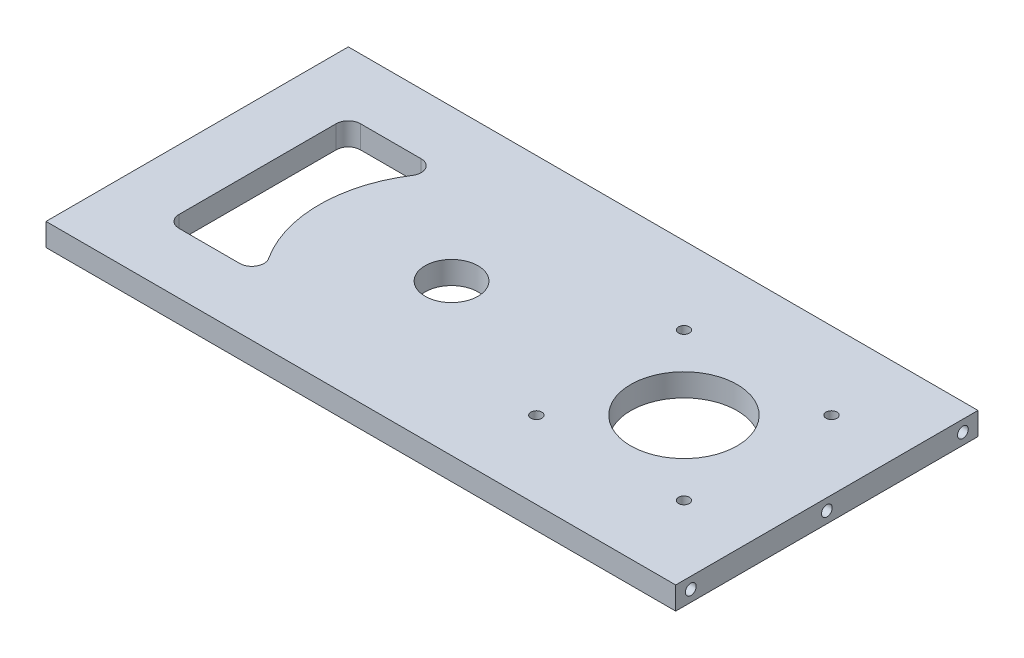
ISO-10303-21;
HEADER;
FILE_DESCRIPTION(('STEP AP214'),'2;1');
FILE_NAME('part.step','',(''),(''),'','','');
FILE_SCHEMA(('AUTOMOTIVE_DESIGN { 1 0 10303 214 1 1 1 1 }'));
ENDSEC;
DATA;
#1=APPLICATION_CONTEXT('core data for automotive mechanical design processes');
#2=APPLICATION_PROTOCOL_DEFINITION('international standard','automotive_design',2000,#1);
#3=PRODUCT_CONTEXT('',#1,'mechanical');
#4=PRODUCT('Part','Part','',(#3));
#5=PRODUCT_RELATED_PRODUCT_CATEGORY('part','',(#4));
#6=PRODUCT_DEFINITION_FORMATION('','',#4);
#7=PRODUCT_DEFINITION_CONTEXT('part definition',#1,'design');
#8=PRODUCT_DEFINITION('design','',#6,#7);
#9=PRODUCT_DEFINITION_SHAPE('','',#8);
#10=(LENGTH_UNIT() NAMED_UNIT(*) SI_UNIT(.MILLI.,.METRE.));
#11=(NAMED_UNIT(*) PLANE_ANGLE_UNIT() SI_UNIT($,.RADIAN.));
#12=(NAMED_UNIT(*) SI_UNIT($,.STERADIAN.) SOLID_ANGLE_UNIT());
#13=UNCERTAINTY_MEASURE_WITH_UNIT(LENGTH_MEASURE(1.E-05),#10,'distance_accuracy_value','');
#14=(GEOMETRIC_REPRESENTATION_CONTEXT(3) GLOBAL_UNCERTAINTY_ASSIGNED_CONTEXT((#13)) GLOBAL_UNIT_ASSIGNED_CONTEXT((#10,
#11,#12)) REPRESENTATION_CONTEXT('',''));
#15=CARTESIAN_POINT('',(0.,0.,0.));
#16=DIRECTION('',(0.,0.,1.));
#17=DIRECTION('',(1.,0.,0.));
#18=AXIS2_PLACEMENT_3D('',#15,#16,#17);
#19=CARTESIAN_POINT('',(66.13525,4.7625,31.75));
#20=DIRECTION('',(-1.,0.,0.));
#21=DIRECTION('',(0.,0.,1.));
#22=AXIS2_PLACEMENT_3D('',#19,#20,#21);
#23=PLANE('',#22);
#24=CARTESIAN_POINT('',(66.13525,2.38125000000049,28.575));
#25=DIRECTION('',(-1.,0.,0.));
#26=DIRECTION('',(0.,0.,-1.));
#27=AXIS2_PLACEMENT_3D('',#24,#25,#26);
#28=CIRCLE('',#27,1.1303);
#29=CARTESIAN_POINT('',(66.13525,2.38125000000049,27.4447));
#30=VERTEX_POINT('',#29);
#31=EDGE_CURVE('E258',#30,#30,#28,.T.);
#32=ORIENTED_EDGE('',*,*,#31,.T.);
#33=EDGE_LOOP('',(#32));
#34=FACE_BOUND('',#33,.T.);
#35=DIRECTION('',(0.,0.,-1.));
#36=VECTOR('',#35,1.);
#37=CARTESIAN_POINT('',(66.13525,0.,31.75));
#38=LINE('',#37,#36);
#39=CARTESIAN_POINT('',(66.13525,0.,31.75));
#40=VERTEX_POINT('',#39);
#41=CARTESIAN_POINT('',(66.13525,0.,-31.75));
#42=VERTEX_POINT('',#41);
#43=EDGE_CURVE('E145',#40,#42,#38,.T.);
#44=ORIENTED_EDGE('',*,*,#43,.T.);
#45=DIRECTION('',(0.,-1.,0.));
#46=VECTOR('',#45,1.);
#47=CARTESIAN_POINT('',(66.13525,4.7625,-31.75));
#48=LINE('',#47,#46);
#49=CARTESIAN_POINT('',(66.13525,4.7625,-31.75));
#50=VERTEX_POINT('',#49);
#51=EDGE_CURVE('E125',#50,#42,#48,.T.);
#52=ORIENTED_EDGE('',*,*,#51,.F.);
#53=DIRECTION('',(0.,0.,-1.));
#54=VECTOR('',#53,1.);
#55=CARTESIAN_POINT('',(66.13525,4.7625,31.75));
#56=LINE('',#55,#54);
#57=CARTESIAN_POINT('',(66.13525,4.7625,31.75));
#58=VERTEX_POINT('',#57);
#59=EDGE_CURVE('E132',#58,#50,#56,.T.);
#60=ORIENTED_EDGE('',*,*,#59,.F.);
#61=DIRECTION('',(0.,-1.,0.));
#62=VECTOR('',#61,1.);
#63=CARTESIAN_POINT('',(66.13525,4.7625,31.75));
#64=LINE('',#63,#62);
#65=EDGE_CURVE('E292',#58,#40,#64,.T.);
#66=ORIENTED_EDGE('',*,*,#65,.T.);
#67=EDGE_LOOP('',(#44,#52,#60,#66));
#68=FACE_BOUND('',#67,.T.);
#69=CARTESIAN_POINT('',(66.13525,2.38125000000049,-28.575));
#70=DIRECTION('',(-1.,0.,0.));
#71=DIRECTION('',(0.,0.,1.));
#72=AXIS2_PLACEMENT_3D('',#69,#70,#71);
#73=CIRCLE('',#72,1.1303);
#74=CARTESIAN_POINT('',(66.13525,2.38125000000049,-27.4447));
#75=VERTEX_POINT('',#74);
#76=EDGE_CURVE('E264',#75,#75,#73,.T.);
#77=ORIENTED_EDGE('',*,*,#76,.T.);
#78=EDGE_LOOP('',(#77));
#79=FACE_BOUND('',#78,.T.);
#80=CARTESIAN_POINT('',(66.13525,2.38125,0.));
#81=DIRECTION('',(-1.,0.,0.));
#82=DIRECTION('',(0.,0.,1.));
#83=AXIS2_PLACEMENT_3D('',#80,#81,#82);
#84=CIRCLE('',#83,1.1303);
#85=CARTESIAN_POINT('',(66.13525,2.38125,1.1303));
#86=VERTEX_POINT('',#85);
#87=EDGE_CURVE('E252',#86,#86,#84,.T.);
#88=ORIENTED_EDGE('',*,*,#87,.T.);
#89=EDGE_LOOP('',(#88));
#90=FACE_BOUND('',#89,.T.);
#91=ADVANCED_FACE('F31',(#34,#68,#79,#90),#23,.F.);
#92=CARTESIAN_POINT('',(-66.13525,4.7625,-31.75));
#93=DIRECTION('',(0.,0.,1.));
#94=DIRECTION('',(1.,0.,0.));
#95=AXIS2_PLACEMENT_3D('',#92,#93,#94);
#96=PLANE('',#95);
#97=DIRECTION('',(-1.,0.,0.));
#98=VECTOR('',#97,1.);
#99=CARTESIAN_POINT('',(-66.13525,0.,-31.75));
#100=LINE('',#99,#98);
#101=CARTESIAN_POINT('',(-66.13525,0.,-31.75));
#102=VERTEX_POINT('',#101);
#103=EDGE_CURVE('E294',#42,#102,#100,.T.);
#104=ORIENTED_EDGE('',*,*,#103,.T.);
#105=DIRECTION('',(0.,-1.,0.));
#106=VECTOR('',#105,1.);
#107=CARTESIAN_POINT('',(-66.13525,4.7625,-31.75));
#108=LINE('',#107,#106);
#109=CARTESIAN_POINT('',(-66.13525,4.7625,-31.75));
#110=VERTEX_POINT('',#109);
#111=EDGE_CURVE('E128',#110,#102,#108,.T.);
#112=ORIENTED_EDGE('',*,*,#111,.F.);
#113=DIRECTION('',(-1.,0.,0.));
#114=VECTOR('',#113,1.);
#115=CARTESIAN_POINT('',(-66.13525,4.7625,-31.75));
#116=LINE('',#115,#114);
#117=EDGE_CURVE('E121',#50,#110,#116,.T.);
#118=ORIENTED_EDGE('',*,*,#117,.F.);
#119=ORIENTED_EDGE('',*,*,#51,.T.);
#120=EDGE_LOOP('',(#104,#112,#118,#119));
#121=FACE_BOUND('',#120,.T.);
#122=ADVANCED_FACE('F123',(#121),#96,.F.);
#123=CARTESIAN_POINT('',(-66.13525,4.7625,31.75));
#124=DIRECTION('',(1.,0.,0.));
#125=DIRECTION('',(0.,0.,-1.));
#126=AXIS2_PLACEMENT_3D('',#123,#124,#125);
#127=PLANE('',#126);
#128=CARTESIAN_POINT('',(-66.13525,2.38125,0.));
#129=DIRECTION('',(-1.,0.,0.));
#130=DIRECTION('',(0.,0.,1.));
#131=AXIS2_PLACEMENT_3D('',#128,#129,#130);
#132=CIRCLE('',#131,1.1303);
#133=CARTESIAN_POINT('',(-66.13525,2.38125,1.1303));
#134=VERTEX_POINT('',#133);
#135=EDGE_CURVE('E270',#134,#134,#132,.T.);
#136=ORIENTED_EDGE('',*,*,#135,.F.);
#137=EDGE_LOOP('',(#136));
#138=FACE_BOUND('',#137,.T.);
#139=CARTESIAN_POINT('',(-66.13525,2.38125000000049,28.575));
#140=DIRECTION('',(-1.,0.,0.));
#141=DIRECTION('',(0.,0.,-1.));
#142=AXIS2_PLACEMENT_3D('',#139,#140,#141);
#143=CIRCLE('',#142,1.1303);
#144=CARTESIAN_POINT('',(-66.13525,2.38125000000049,27.4447));
#145=VERTEX_POINT('',#144);
#146=EDGE_CURVE('E276',#145,#145,#143,.T.);
#147=ORIENTED_EDGE('',*,*,#146,.F.);
#148=EDGE_LOOP('',(#147));
#149=FACE_BOUND('',#148,.T.);
#150=CARTESIAN_POINT('',(-66.13525,2.38125000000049,-28.575));
#151=DIRECTION('',(-1.,0.,0.));
#152=DIRECTION('',(0.,0.,1.));
#153=AXIS2_PLACEMENT_3D('',#150,#151,#152);
#154=CIRCLE('',#153,1.1303);
#155=CARTESIAN_POINT('',(-66.13525,2.38125000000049,-27.4447));
#156=VERTEX_POINT('',#155);
#157=EDGE_CURVE('E282',#156,#156,#154,.T.);
#158=ORIENTED_EDGE('',*,*,#157,.F.);
#159=EDGE_LOOP('',(#158));
#160=FACE_BOUND('',#159,.T.);
#161=DIRECTION('',(0.,0.,1.));
#162=VECTOR('',#161,1.);
#163=CARTESIAN_POINT('',(-66.13525,0.,31.75));
#164=LINE('',#163,#162);
#165=CARTESIAN_POINT('',(-66.13525,0.,31.75));
#166=VERTEX_POINT('',#165);
#167=EDGE_CURVE('E296',#102,#166,#164,.T.);
#168=ORIENTED_EDGE('',*,*,#167,.T.);
#169=DIRECTION('',(0.,-1.,0.));
#170=VECTOR('',#169,1.);
#171=CARTESIAN_POINT('',(-66.13525,4.7625,31.75));
#172=LINE('',#171,#170);
#173=CARTESIAN_POINT('',(-66.13525,4.7625,31.75));
#174=VERTEX_POINT('',#173);
#175=EDGE_CURVE('E150',#174,#166,#172,.T.);
#176=ORIENTED_EDGE('',*,*,#175,.F.);
#177=DIRECTION('',(0.,0.,1.));
#178=VECTOR('',#177,1.);
#179=CARTESIAN_POINT('',(-66.13525,4.7625,31.75));
#180=LINE('',#179,#178);
#181=EDGE_CURVE('E131',#110,#174,#180,.T.);
#182=ORIENTED_EDGE('',*,*,#181,.F.);
#183=ORIENTED_EDGE('',*,*,#111,.T.);
#184=EDGE_LOOP('',(#168,#176,#182,#183));
#185=FACE_BOUND('',#184,.T.);
#186=ADVANCED_FACE('F307',(#138,#149,#160,#185),#127,.F.);
#187=CARTESIAN_POINT('',(-66.13525,4.7625,31.75));
#188=DIRECTION('',(0.,0.,-1.));
#189=DIRECTION('',(-1.,0.,0.));
#190=AXIS2_PLACEMENT_3D('',#187,#188,#189);
#191=PLANE('',#190);
#192=DIRECTION('',(1.,0.,0.));
#193=VECTOR('',#192,1.);
#194=CARTESIAN_POINT('',(-66.13525,0.,31.75));
#195=LINE('',#194,#193);
#196=EDGE_CURVE('E141',#166,#40,#195,.T.);
#197=ORIENTED_EDGE('',*,*,#196,.T.);
#198=ORIENTED_EDGE('',*,*,#65,.F.);
#199=DIRECTION('',(1.,0.,0.));
#200=VECTOR('',#199,1.);
#201=CARTESIAN_POINT('',(-66.13525,4.7625,31.75));
#202=LINE('',#201,#200);
#203=EDGE_CURVE('E137',#174,#58,#202,.T.);
#204=ORIENTED_EDGE('',*,*,#203,.F.);
#205=ORIENTED_EDGE('',*,*,#175,.T.);
#206=EDGE_LOOP('',(#197,#198,#204,#205));
#207=FACE_BOUND('',#206,.T.);
#208=ADVANCED_FACE('F303',(#207),#191,.F.);
#209=CARTESIAN_POINT('',(66.13525,4.7625,-31.75));
#210=DIRECTION('',(0.,-1.,0.));
#211=DIRECTION('',(0.,0.,-1.));
#212=AXIS2_PLACEMENT_3D('',#209,#210,#211);
#213=PLANE('',#212);
#214=DIRECTION('',(0.,0.,1.));
#215=VECTOR('',#214,1.);
#216=CARTESIAN_POINT('',(-53.43525,4.7625,-19.05));
#217=LINE('',#216,#215);
#218=CARTESIAN_POINT('',(-53.43525,4.7625,-16.51));
#219=VERTEX_POINT('',#218);
#220=CARTESIAN_POINT('',(-53.43525,4.7625,16.51));
#221=VERTEX_POINT('',#220);
#222=EDGE_CURVE('E186',#219,#221,#217,.T.);
#223=ORIENTED_EDGE('',*,*,#222,.F.);
#224=CARTESIAN_POINT('',(-50.89525,4.7625,-16.51));
#225=DIRECTION('',(0.,-1.,0.));
#226=DIRECTION('',(0.,0.,-1.));
#227=AXIS2_PLACEMENT_3D('',#224,#225,#226);
#228=CIRCLE('',#227,2.54);
#229=CARTESIAN_POINT('',(-50.89525,4.7625,-19.05));
#230=VERTEX_POINT('',#229);
#231=EDGE_CURVE('E39',#219,#230,#228,.T.);
#232=ORIENTED_EDGE('',*,*,#231,.T.);
#233=DIRECTION('',(-1.,0.,0.));
#234=VECTOR('',#233,1.);
#235=CARTESIAN_POINT('',(-32.9211609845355,4.7625,-19.05));
#236=LINE('',#235,#234);
#237=CARTESIAN_POINT('',(-38.1322256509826,4.7625,-19.05));
#238=VERTEX_POINT('',#237);
#239=EDGE_CURVE('E184',#238,#230,#236,.T.);
#240=ORIENTED_EDGE('',*,*,#239,.F.);
#241=CARTESIAN_POINT('',(-38.1322256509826,4.7625,-16.51));
#242=DIRECTION('',(0.,-1.,0.));
#243=DIRECTION('',(0.,0.,-1.));
#244=AXIS2_PLACEMENT_3D('',#241,#242,#243);
#245=CIRCLE('',#244,2.54);
#246=CARTESIAN_POINT('',(-36.0017774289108,4.7625,-15.1269633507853));
#247=VERTEX_POINT('',#246);
#248=EDGE_CURVE('E178',#238,#247,#245,.T.);
#249=ORIENTED_EDGE('',*,*,#248,.T.);
#250=CARTESIAN_POINT('',(-12.7,4.7625,0.));
#251=DIRECTION('',(0.,-1.,0.));
#252=DIRECTION('',(0.,0.,1.));
#253=AXIS2_PLACEMENT_3D('',#250,#251,#252);
#254=CIRCLE('',#253,27.78125);
#255=CARTESIAN_POINT('',(-36.0017774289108,4.7625,15.1269633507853));
#256=VERTEX_POINT('',#255);
#257=EDGE_CURVE('E208',#256,#247,#254,.T.);
#258=ORIENTED_EDGE('',*,*,#257,.F.);
#259=CARTESIAN_POINT('',(-38.1322256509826,4.7625,16.51));
#260=DIRECTION('',(0.,-1.,0.));
#261=DIRECTION('',(0.,0.,-1.));
#262=AXIS2_PLACEMENT_3D('',#259,#260,#261);
#263=CIRCLE('',#262,2.54);
#264=CARTESIAN_POINT('',(-38.1322256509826,4.7625,19.05));
#265=VERTEX_POINT('',#264);
#266=EDGE_CURVE('E174',#256,#265,#263,.T.);
#267=ORIENTED_EDGE('',*,*,#266,.T.);
#268=DIRECTION('',(1.,0.,0.));
#269=VECTOR('',#268,1.);
#270=CARTESIAN_POINT('',(-53.43525,4.7625,19.05));
#271=LINE('',#270,#269);
#272=CARTESIAN_POINT('',(-50.89525,4.7625,19.05));
#273=VERTEX_POINT('',#272);
#274=EDGE_CURVE('E214',#273,#265,#271,.T.);
#275=ORIENTED_EDGE('',*,*,#274,.F.);
#276=CARTESIAN_POINT('',(-50.89525,4.7625,16.51));
#277=DIRECTION('',(0.,-1.,0.));
#278=DIRECTION('',(0.,0.,-1.));
#279=AXIS2_PLACEMENT_3D('',#276,#277,#278);
#280=CIRCLE('',#279,2.54);
#281=EDGE_CURVE('E170',#273,#221,#280,.T.);
#282=ORIENTED_EDGE('',*,*,#281,.T.);
#283=EDGE_LOOP('',(#223,#232,#240,#249,#258,#267,#275,#282));
#284=FACE_BOUND('',#283,.T.);
#285=CARTESIAN_POINT('',(20.61626,4.7625,15.5));
#286=DIRECTION('',(0.,1.,0.));
#287=DIRECTION('',(0.,0.,1.));
#288=AXIS2_PLACEMENT_3D('',#285,#286,#287);
#289=CIRCLE('',#288,1.143);
#290=CARTESIAN_POINT('',(20.61626,4.7625,16.643));
#291=VERTEX_POINT('',#290);
#292=EDGE_CURVE('E211',#291,#291,#289,.T.);
#293=ORIENTED_EDGE('',*,*,#292,.F.);
#294=EDGE_LOOP('',(#293));
#295=FACE_BOUND('',#294,.T.);
#296=CARTESIAN_POINT('',(51.61626,4.7625,15.5));
#297=DIRECTION('',(0.,1.,0.));
#298=DIRECTION('',(0.,0.,1.));
#299=AXIS2_PLACEMENT_3D('',#296,#297,#298);
#300=CIRCLE('',#299,1.143);
#301=CARTESIAN_POINT('',(51.61626,4.7625,16.643));
#302=VERTEX_POINT('',#301);
#303=EDGE_CURVE('E222',#302,#302,#300,.T.);
#304=ORIENTED_EDGE('',*,*,#303,.F.);
#305=EDGE_LOOP('',(#304));
#306=FACE_BOUND('',#305,.T.);
#307=CARTESIAN_POINT('',(51.61626,4.7625,-15.5));
#308=DIRECTION('',(0.,1.,0.));
#309=DIRECTION('',(0.,0.,1.));
#310=AXIS2_PLACEMENT_3D('',#307,#308,#309);
#311=CIRCLE('',#310,1.143);
#312=CARTESIAN_POINT('',(51.61626,4.7625,-14.357));
#313=VERTEX_POINT('',#312);
#314=EDGE_CURVE('E228',#313,#313,#311,.T.);
#315=ORIENTED_EDGE('',*,*,#314,.F.);
#316=EDGE_LOOP('',(#315));
#317=FACE_BOUND('',#316,.T.);
#318=CARTESIAN_POINT('',(20.61626,4.7625,-15.5));
#319=DIRECTION('',(0.,1.,0.));
#320=DIRECTION('',(0.,0.,1.));
#321=AXIS2_PLACEMENT_3D('',#318,#319,#320);
#322=CIRCLE('',#321,1.143);
#323=CARTESIAN_POINT('',(20.61626,4.7625,-14.357));
#324=VERTEX_POINT('',#323);
#325=EDGE_CURVE('E234',#324,#324,#322,.T.);
#326=ORIENTED_EDGE('',*,*,#325,.F.);
#327=EDGE_LOOP('',(#326));
#328=FACE_BOUND('',#327,.T.);
#329=CARTESIAN_POINT('',(36.11626,4.7625,0.));
#330=DIRECTION('',(0.,1.,0.));
#331=DIRECTION('',(0.,0.,1.));
#332=AXIS2_PLACEMENT_3D('',#329,#330,#331);
#333=CIRCLE('',#332,11.176);
#334=CARTESIAN_POINT('',(36.11626,4.7625,11.176));
#335=VERTEX_POINT('',#334);
#336=EDGE_CURVE('E240',#335,#335,#333,.T.);
#337=ORIENTED_EDGE('',*,*,#336,.F.);
#338=EDGE_LOOP('',(#337));
#339=FACE_BOUND('',#338,.T.);
#340=CARTESIAN_POINT('',(-12.7,4.7625,0.));
#341=DIRECTION('',(0.,1.,0.));
#342=DIRECTION('',(0.,0.,1.));
#343=AXIS2_PLACEMENT_3D('',#340,#341,#342);
#344=CIRCLE('',#343,5.55625);
#345=CARTESIAN_POINT('',(-12.7,4.7625,5.55625));
#346=VERTEX_POINT('',#345);
#347=EDGE_CURVE('E246',#346,#346,#344,.T.);
#348=ORIENTED_EDGE('',*,*,#347,.F.);
#349=EDGE_LOOP('',(#348));
#350=FACE_BOUND('',#349,.T.);
#351=ORIENTED_EDGE('',*,*,#59,.T.);
#352=ORIENTED_EDGE('',*,*,#117,.T.);
#353=ORIENTED_EDGE('',*,*,#181,.T.);
#354=ORIENTED_EDGE('',*,*,#203,.T.);
#355=EDGE_LOOP('',(#351,#352,#353,#354));
#356=FACE_BOUND('',#355,.T.);
#357=ADVANCED_FACE('F135',(#284,#295,#306,#317,#328,#339,#350,#356),#213,.F.);
#358=CARTESIAN_POINT('',(66.13525,0.,-31.75));
#359=DIRECTION('',(0.,-1.,0.));
#360=DIRECTION('',(0.,0.,-1.));
#361=AXIS2_PLACEMENT_3D('',#358,#359,#360);
#362=PLANE('',#361);
#363=CARTESIAN_POINT('',(-12.7,0.,0.));
#364=DIRECTION('',(0.,-1.,0.));
#365=DIRECTION('',(0.,0.,1.));
#366=AXIS2_PLACEMENT_3D('',#363,#364,#365);
#367=CIRCLE('',#366,27.78125);
#368=CARTESIAN_POINT('',(-36.0017774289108,0.,15.1269633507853));
#369=VERTEX_POINT('',#368);
#370=CARTESIAN_POINT('',(-36.0017774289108,0.,-15.1269633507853));
#371=VERTEX_POINT('',#370);
#372=EDGE_CURVE('E206',#369,#371,#367,.T.);
#373=ORIENTED_EDGE('',*,*,#372,.T.);
#374=CARTESIAN_POINT('',(-38.1322256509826,0.,-16.51));
#375=DIRECTION('',(0.,-1.,0.));
#376=DIRECTION('',(0.,0.,-1.));
#377=AXIS2_PLACEMENT_3D('',#374,#375,#376);
#378=CIRCLE('',#377,2.54);
#379=CARTESIAN_POINT('',(-38.1322256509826,0.,-19.05));
#380=VERTEX_POINT('',#379);
#381=EDGE_CURVE('E53',#371,#380,#378,.F.);
#382=ORIENTED_EDGE('',*,*,#381,.T.);
#383=DIRECTION('',(-1.,0.,0.));
#384=VECTOR('',#383,1.);
#385=CARTESIAN_POINT('',(-32.9211609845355,0.,-19.05));
#386=LINE('',#385,#384);
#387=CARTESIAN_POINT('',(-50.89525,0.,-19.05));
#388=VERTEX_POINT('',#387);
#389=EDGE_CURVE('E199',#380,#388,#386,.T.);
#390=ORIENTED_EDGE('',*,*,#389,.T.);
#391=CARTESIAN_POINT('',(-50.89525,0.,-16.51));
#392=DIRECTION('',(0.,-1.,0.));
#393=DIRECTION('',(0.,0.,-1.));
#394=AXIS2_PLACEMENT_3D('',#391,#392,#393);
#395=CIRCLE('',#394,2.54);
#396=CARTESIAN_POINT('',(-53.43525,0.,-16.51));
#397=VERTEX_POINT('',#396);
#398=EDGE_CURVE('E11',#388,#397,#395,.F.);
#399=ORIENTED_EDGE('',*,*,#398,.T.);
#400=DIRECTION('',(0.,0.,1.));
#401=VECTOR('',#400,1.);
#402=CARTESIAN_POINT('',(-53.43525,0.,-19.05));
#403=LINE('',#402,#401);
#404=CARTESIAN_POINT('',(-53.43525,0.,16.51));
#405=VERTEX_POINT('',#404);
#406=EDGE_CURVE('E197',#397,#405,#403,.T.);
#407=ORIENTED_EDGE('',*,*,#406,.T.);
#408=CARTESIAN_POINT('',(-50.89525,0.,16.51));
#409=DIRECTION('',(0.,-1.,0.));
#410=DIRECTION('',(0.,0.,-1.));
#411=AXIS2_PLACEMENT_3D('',#408,#409,#410);
#412=CIRCLE('',#411,2.54);
#413=CARTESIAN_POINT('',(-50.89525,0.,19.05));
#414=VERTEX_POINT('',#413);
#415=EDGE_CURVE('E172',#405,#414,#412,.F.);
#416=ORIENTED_EDGE('',*,*,#415,.T.);
#417=DIRECTION('',(1.,0.,0.));
#418=VECTOR('',#417,1.);
#419=CARTESIAN_POINT('',(-53.43525,0.,19.05));
#420=LINE('',#419,#418);
#421=CARTESIAN_POINT('',(-38.1322256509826,0.,19.05));
#422=VERTEX_POINT('',#421);
#423=EDGE_CURVE('E203',#414,#422,#420,.T.);
#424=ORIENTED_EDGE('',*,*,#423,.T.);
#425=CARTESIAN_POINT('',(-38.1322256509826,0.,16.51));
#426=DIRECTION('',(0.,-1.,0.));
#427=DIRECTION('',(0.,0.,-1.));
#428=AXIS2_PLACEMENT_3D('',#425,#426,#427);
#429=CIRCLE('',#428,2.54);
#430=EDGE_CURVE('E176',#422,#369,#429,.F.);
#431=ORIENTED_EDGE('',*,*,#430,.T.);
#432=EDGE_LOOP('',(#373,#382,#390,#399,#407,#416,#424,#431));
#433=FACE_BOUND('',#432,.T.);
#434=CARTESIAN_POINT('',(20.61626,0.,15.5));
#435=DIRECTION('',(0.,1.,0.));
#436=DIRECTION('',(0.,0.,1.));
#437=AXIS2_PLACEMENT_3D('',#434,#435,#436);
#438=CIRCLE('',#437,1.143);
#439=CARTESIAN_POINT('',(20.61626,0.,16.643));
#440=VERTEX_POINT('',#439);
#441=EDGE_CURVE('E219',#440,#440,#438,.T.);
#442=ORIENTED_EDGE('',*,*,#441,.T.);
#443=EDGE_LOOP('',(#442));
#444=FACE_BOUND('',#443,.T.);
#445=CARTESIAN_POINT('',(51.61626,0.,15.5));
#446=DIRECTION('',(0.,1.,0.));
#447=DIRECTION('',(0.,0.,1.));
#448=AXIS2_PLACEMENT_3D('',#445,#446,#447);
#449=CIRCLE('',#448,1.143);
#450=CARTESIAN_POINT('',(51.61626,0.,16.643));
#451=VERTEX_POINT('',#450);
#452=EDGE_CURVE('E225',#451,#451,#449,.T.);
#453=ORIENTED_EDGE('',*,*,#452,.T.);
#454=EDGE_LOOP('',(#453));
#455=FACE_BOUND('',#454,.T.);
#456=CARTESIAN_POINT('',(51.61626,0.,-15.5));
#457=DIRECTION('',(0.,1.,0.));
#458=DIRECTION('',(0.,0.,1.));
#459=AXIS2_PLACEMENT_3D('',#456,#457,#458);
#460=CIRCLE('',#459,1.143);
#461=CARTESIAN_POINT('',(51.61626,0.,-14.357));
#462=VERTEX_POINT('',#461);
#463=EDGE_CURVE('E231',#462,#462,#460,.T.);
#464=ORIENTED_EDGE('',*,*,#463,.T.);
#465=EDGE_LOOP('',(#464));
#466=FACE_BOUND('',#465,.T.);
#467=CARTESIAN_POINT('',(20.61626,0.,-15.5));
#468=DIRECTION('',(0.,1.,0.));
#469=DIRECTION('',(0.,0.,1.));
#470=AXIS2_PLACEMENT_3D('',#467,#468,#469);
#471=CIRCLE('',#470,1.143);
#472=CARTESIAN_POINT('',(20.61626,0.,-14.357));
#473=VERTEX_POINT('',#472);
#474=EDGE_CURVE('E237',#473,#473,#471,.T.);
#475=ORIENTED_EDGE('',*,*,#474,.T.);
#476=EDGE_LOOP('',(#475));
#477=FACE_BOUND('',#476,.T.);
#478=CARTESIAN_POINT('',(36.11626,0.,0.));
#479=DIRECTION('',(0.,1.,0.));
#480=DIRECTION('',(0.,0.,1.));
#481=AXIS2_PLACEMENT_3D('',#478,#479,#480);
#482=CIRCLE('',#481,11.176);
#483=CARTESIAN_POINT('',(36.11626,0.,11.176));
#484=VERTEX_POINT('',#483);
#485=EDGE_CURVE('E243',#484,#484,#482,.T.);
#486=ORIENTED_EDGE('',*,*,#485,.T.);
#487=EDGE_LOOP('',(#486));
#488=FACE_BOUND('',#487,.T.);
#489=CARTESIAN_POINT('',(-12.7,0.,0.));
#490=DIRECTION('',(0.,1.,0.));
#491=DIRECTION('',(0.,0.,1.));
#492=AXIS2_PLACEMENT_3D('',#489,#490,#491);
#493=CIRCLE('',#492,5.55625);
#494=CARTESIAN_POINT('',(-12.7,0.,5.55625));
#495=VERTEX_POINT('',#494);
#496=EDGE_CURVE('E249',#495,#495,#493,.T.);
#497=ORIENTED_EDGE('',*,*,#496,.T.);
#498=EDGE_LOOP('',(#497));
#499=FACE_BOUND('',#498,.T.);
#500=ORIENTED_EDGE('',*,*,#43,.F.);
#501=ORIENTED_EDGE('',*,*,#196,.F.);
#502=ORIENTED_EDGE('',*,*,#167,.F.);
#503=ORIENTED_EDGE('',*,*,#103,.F.);
#504=EDGE_LOOP('',(#500,#501,#502,#503));
#505=FACE_BOUND('',#504,.T.);
#506=ADVANCED_FACE('F195',(#433,#444,#455,#466,#477,#488,#499,#505),#362,.T.);
#507=CARTESIAN_POINT('',(-55.97525,2.38125000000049,-28.575));
#508=DIRECTION('',(-1.,0.,0.));
#509=DIRECTION('',(0.,0.,1.));
#510=AXIS2_PLACEMENT_3D('',#507,#508,#509);
#511=CYLINDRICAL_SURFACE('',#510,1.1303);
#512=CARTESIAN_POINT('',(-55.97525,2.38125000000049,-28.575));
#513=DIRECTION('',(-1.,0.,0.));
#514=DIRECTION('',(0.,0.,1.));
#515=AXIS2_PLACEMENT_3D('',#512,#513,#514);
#516=CIRCLE('',#515,1.1303);
#517=CARTESIAN_POINT('',(-55.97525,2.38125000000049,-27.4447));
#518=VERTEX_POINT('',#517);
#519=EDGE_CURVE('E285',#518,#518,#516,.T.);
#520=ORIENTED_EDGE('',*,*,#519,.F.);
#521=EDGE_LOOP('',(#520));
#522=FACE_BOUND('',#521,.T.);
#523=ORIENTED_EDGE('',*,*,#157,.T.);
#524=EDGE_LOOP('',(#523));
#525=FACE_BOUND('',#524,.T.);
#526=ADVANCED_FACE('F429',(#522,#525),#511,.F.);
#527=CARTESIAN_POINT('',(-55.97525,2.38125000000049,-28.575));
#528=DIRECTION('',(-1.,0.,0.));
#529=DIRECTION('',(0.,0.,1.));
#530=AXIS2_PLACEMENT_3D('',#527,#528,#529);
#531=PLANE('',#530);
#532=ORIENTED_EDGE('',*,*,#519,.T.);
#533=EDGE_LOOP('',(#532));
#534=FACE_BOUND('',#533,.T.);
#535=ADVANCED_FACE('F425',(#534),#531,.T.);
#536=CARTESIAN_POINT('',(-55.97525,2.38125000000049,28.575));
#537=DIRECTION('',(-1.,0.,0.));
#538=DIRECTION('',(0.,0.,1.));
#539=AXIS2_PLACEMENT_3D('',#536,#537,#538);
#540=CYLINDRICAL_SURFACE('',#539,1.1303);
#541=CARTESIAN_POINT('',(-55.97525,2.38125000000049,28.575));
#542=DIRECTION('',(-1.,0.,0.));
#543=DIRECTION('',(0.,0.,-1.));
#544=AXIS2_PLACEMENT_3D('',#541,#542,#543);
#545=CIRCLE('',#544,1.1303);
#546=CARTESIAN_POINT('',(-55.97525,2.38125000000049,27.4447));
#547=VERTEX_POINT('',#546);
#548=EDGE_CURVE('E279',#547,#547,#545,.T.);
#549=ORIENTED_EDGE('',*,*,#548,.F.);
#550=EDGE_LOOP('',(#549));
#551=FACE_BOUND('',#550,.T.);
#552=ORIENTED_EDGE('',*,*,#146,.T.);
#553=EDGE_LOOP('',(#552));
#554=FACE_BOUND('',#553,.T.);
#555=ADVANCED_FACE('F421',(#551,#554),#540,.F.);
#556=CARTESIAN_POINT('',(-55.97525,2.38125000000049,28.575));
#557=DIRECTION('',(1.,0.,0.));
#558=DIRECTION('',(0.,0.,-1.));
#559=AXIS2_PLACEMENT_3D('',#556,#557,#558);
#560=PLANE('',#559);
#561=ORIENTED_EDGE('',*,*,#548,.T.);
#562=EDGE_LOOP('',(#561));
#563=FACE_BOUND('',#562,.T.);
#564=ADVANCED_FACE('F417',(#563),#560,.F.);
#565=CARTESIAN_POINT('',(-55.97525,2.38125,0.));
#566=DIRECTION('',(-1.,0.,0.));
#567=DIRECTION('',(0.,0.,1.));
#568=AXIS2_PLACEMENT_3D('',#565,#566,#567);
#569=CYLINDRICAL_SURFACE('',#568,1.1303);
#570=CARTESIAN_POINT('',(-55.97525,2.38125,0.));
#571=DIRECTION('',(-1.,0.,0.));
#572=DIRECTION('',(0.,0.,1.));
#573=AXIS2_PLACEMENT_3D('',#570,#571,#572);
#574=CIRCLE('',#573,1.1303);
#575=CARTESIAN_POINT('',(-55.97525,2.38125,1.1303));
#576=VERTEX_POINT('',#575);
#577=EDGE_CURVE('E273',#576,#576,#574,.T.);
#578=ORIENTED_EDGE('',*,*,#577,.F.);
#579=EDGE_LOOP('',(#578));
#580=FACE_BOUND('',#579,.T.);
#581=ORIENTED_EDGE('',*,*,#135,.T.);
#582=EDGE_LOOP('',(#581));
#583=FACE_BOUND('',#582,.T.);
#584=ADVANCED_FACE('F413',(#580,#583),#569,.F.);
#585=CARTESIAN_POINT('',(-55.97525,2.38125,0.));
#586=DIRECTION('',(-1.,0.,0.));
#587=DIRECTION('',(0.,0.,1.));
#588=AXIS2_PLACEMENT_3D('',#585,#586,#587);
#589=PLANE('',#588);
#590=ORIENTED_EDGE('',*,*,#577,.T.);
#591=EDGE_LOOP('',(#590));
#592=FACE_BOUND('',#591,.T.);
#593=ADVANCED_FACE('F409',(#592),#589,.T.);
#594=CARTESIAN_POINT('',(55.97525,2.38125000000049,-28.575));
#595=DIRECTION('',(1.,0.,0.));
#596=DIRECTION('',(0.,0.,-1.));
#597=AXIS2_PLACEMENT_3D('',#594,#595,#596);
#598=CYLINDRICAL_SURFACE('',#597,1.1303);
#599=CARTESIAN_POINT('',(55.97525,2.38125000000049,-28.575));
#600=DIRECTION('',(-1.,0.,0.));
#601=DIRECTION('',(0.,0.,1.));
#602=AXIS2_PLACEMENT_3D('',#599,#600,#601);
#603=CIRCLE('',#602,1.1303);
#604=CARTESIAN_POINT('',(55.97525,2.38125000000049,-27.4447));
#605=VERTEX_POINT('',#604);
#606=EDGE_CURVE('E267',#605,#605,#603,.T.);
#607=ORIENTED_EDGE('',*,*,#606,.T.);
#608=EDGE_LOOP('',(#607));
#609=FACE_BOUND('',#608,.T.);
#610=ORIENTED_EDGE('',*,*,#76,.F.);
#611=EDGE_LOOP('',(#610));
#612=FACE_BOUND('',#611,.T.);
#613=ADVANCED_FACE('F405',(#609,#612),#598,.F.);
#614=CARTESIAN_POINT('',(55.97525,2.38125000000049,-28.575));
#615=DIRECTION('',(1.,0.,0.));
#616=DIRECTION('',(0.,0.,1.));
#617=AXIS2_PLACEMENT_3D('',#614,#615,#616);
#618=PLANE('',#617);
#619=ORIENTED_EDGE('',*,*,#606,.F.);
#620=EDGE_LOOP('',(#619));
#621=FACE_BOUND('',#620,.T.);
#622=ADVANCED_FACE('F401',(#621),#618,.T.);
#623=CARTESIAN_POINT('',(55.97525,2.38125000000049,28.575));
#624=DIRECTION('',(1.,0.,0.));
#625=DIRECTION('',(0.,0.,-1.));
#626=AXIS2_PLACEMENT_3D('',#623,#624,#625);
#627=CYLINDRICAL_SURFACE('',#626,1.1303);
#628=CARTESIAN_POINT('',(55.97525,2.38125000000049,28.575));
#629=DIRECTION('',(-1.,0.,0.));
#630=DIRECTION('',(0.,0.,-1.));
#631=AXIS2_PLACEMENT_3D('',#628,#629,#630);
#632=CIRCLE('',#631,1.1303);
#633=CARTESIAN_POINT('',(55.97525,2.38125000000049,27.4447));
#634=VERTEX_POINT('',#633);
#635=EDGE_CURVE('E261',#634,#634,#632,.T.);
#636=ORIENTED_EDGE('',*,*,#635,.T.);
#637=EDGE_LOOP('',(#636));
#638=FACE_BOUND('',#637,.T.);
#639=ORIENTED_EDGE('',*,*,#31,.F.);
#640=EDGE_LOOP('',(#639));
#641=FACE_BOUND('',#640,.T.);
#642=ADVANCED_FACE('F397',(#638,#641),#627,.F.);
#643=CARTESIAN_POINT('',(55.97525,2.38125000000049,28.575));
#644=DIRECTION('',(-1.,0.,0.));
#645=DIRECTION('',(0.,0.,-1.));
#646=AXIS2_PLACEMENT_3D('',#643,#644,#645);
#647=PLANE('',#646);
#648=ORIENTED_EDGE('',*,*,#635,.F.);
#649=EDGE_LOOP('',(#648));
#650=FACE_BOUND('',#649,.T.);
#651=ADVANCED_FACE('F393',(#650),#647,.F.);
#652=CARTESIAN_POINT('',(55.97525,2.38125,0.));
#653=DIRECTION('',(1.,0.,0.));
#654=DIRECTION('',(0.,0.,-1.));
#655=AXIS2_PLACEMENT_3D('',#652,#653,#654);
#656=CYLINDRICAL_SURFACE('',#655,1.1303);
#657=CARTESIAN_POINT('',(55.97525,2.38125,0.));
#658=DIRECTION('',(-1.,0.,0.));
#659=DIRECTION('',(0.,0.,1.));
#660=AXIS2_PLACEMENT_3D('',#657,#658,#659);
#661=CIRCLE('',#660,1.1303);
#662=CARTESIAN_POINT('',(55.97525,2.38125,1.1303));
#663=VERTEX_POINT('',#662);
#664=EDGE_CURVE('E255',#663,#663,#661,.T.);
#665=ORIENTED_EDGE('',*,*,#664,.T.);
#666=EDGE_LOOP('',(#665));
#667=FACE_BOUND('',#666,.T.);
#668=ORIENTED_EDGE('',*,*,#87,.F.);
#669=EDGE_LOOP('',(#668));
#670=FACE_BOUND('',#669,.T.);
#671=ADVANCED_FACE('F389',(#667,#670),#656,.F.);
#672=CARTESIAN_POINT('',(55.97525,2.38125,0.));
#673=DIRECTION('',(1.,0.,0.));
#674=DIRECTION('',(0.,0.,1.));
#675=AXIS2_PLACEMENT_3D('',#672,#673,#674);
#676=PLANE('',#675);
#677=ORIENTED_EDGE('',*,*,#664,.F.);
#678=EDGE_LOOP('',(#677));
#679=FACE_BOUND('',#678,.T.);
#680=ADVANCED_FACE('F385',(#679),#676,.T.);
#681=CARTESIAN_POINT('',(-12.7,0.,0.));
#682=DIRECTION('',(0.,1.,0.));
#683=DIRECTION('',(0.,0.,1.));
#684=AXIS2_PLACEMENT_3D('',#681,#682,#683);
#685=CYLINDRICAL_SURFACE('',#684,5.55625);
#686=CARTESIAN_POINT('',(-12.7,0.,5.55625));
#687=CARTESIAN_POINT('',(-12.7,0.049609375,5.55625));
#688=CARTESIAN_POINT('',(-12.7,0.09921875,5.55625));
#689=CARTESIAN_POINT('',(-12.7,0.1984375,5.55625));
#690=CARTESIAN_POINT('',(-12.7,0.248046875,5.55625));
#691=CARTESIAN_POINT('',(-12.7,0.347265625,5.55625));
#692=CARTESIAN_POINT('',(-12.7,0.396875,5.55625));
#693=CARTESIAN_POINT('',(-12.7,0.49609375,5.55625));
#694=CARTESIAN_POINT('',(-12.7,0.545703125,5.55625));
#695=CARTESIAN_POINT('',(-12.7,0.644921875,5.55625));
#696=CARTESIAN_POINT('',(-12.7,0.69453125,5.55625));
#697=CARTESIAN_POINT('',(-12.7,0.79375,5.55625));
#698=CARTESIAN_POINT('',(-12.7,0.843359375,5.55625));
#699=CARTESIAN_POINT('',(-12.7,0.942578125,5.55625));
#700=CARTESIAN_POINT('',(-12.7,0.9921875,5.55625));
#701=CARTESIAN_POINT('',(-12.7,1.09140625,5.55625));
#702=CARTESIAN_POINT('',(-12.7,1.141015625,5.55625));
#703=CARTESIAN_POINT('',(-12.7,1.240234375,5.55625));
#704=CARTESIAN_POINT('',(-12.7,1.28984375,5.55625));
#705=CARTESIAN_POINT('',(-12.7,1.3890625,5.55625));
#706=CARTESIAN_POINT('',(-12.7,1.438671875,5.55625));
#707=CARTESIAN_POINT('',(-12.7,1.537890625,5.55625));
#708=CARTESIAN_POINT('',(-12.7,1.5875,5.55625));
#709=CARTESIAN_POINT('',(-12.7,1.68671875,5.55625));
#710=CARTESIAN_POINT('',(-12.7,1.736328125,5.55625));
#711=CARTESIAN_POINT('',(-12.7,1.835546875,5.55625));
#712=CARTESIAN_POINT('',(-12.7,1.88515625,5.55625));
#713=CARTESIAN_POINT('',(-12.7,1.984375,5.55625));
#714=CARTESIAN_POINT('',(-12.7,2.033984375,5.55625));
#715=CARTESIAN_POINT('',(-12.7,2.133203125,5.55625));
#716=CARTESIAN_POINT('',(-12.7,2.1828125,5.55625));
#717=CARTESIAN_POINT('',(-12.7,2.28203125,5.55625));
#718=CARTESIAN_POINT('',(-12.7,2.331640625,5.55625));
#719=CARTESIAN_POINT('',(-12.7,2.430859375,5.55625));
#720=CARTESIAN_POINT('',(-12.7,2.48046875,5.55625));
#721=CARTESIAN_POINT('',(-12.7,2.5796875,5.55625));
#722=CARTESIAN_POINT('',(-12.7,2.629296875,5.55625));
#723=CARTESIAN_POINT('',(-12.7,2.728515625,5.55625));
#724=CARTESIAN_POINT('',(-12.7,2.778125,5.55625));
#725=CARTESIAN_POINT('',(-12.7,2.87734375,5.55625));
#726=CARTESIAN_POINT('',(-12.7,2.926953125,5.55625));
#727=CARTESIAN_POINT('',(-12.7,3.026171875,5.55625));
#728=CARTESIAN_POINT('',(-12.7,3.07578125,5.55625));
#729=CARTESIAN_POINT('',(-12.7,3.175,5.55625));
#730=CARTESIAN_POINT('',(-12.7,3.224609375,5.55625));
#731=CARTESIAN_POINT('',(-12.7,3.323828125,5.55625));
#732=CARTESIAN_POINT('',(-12.7,3.3734375,5.55625));
#733=CARTESIAN_POINT('',(-12.7,3.47265625,5.55625));
#734=CARTESIAN_POINT('',(-12.7,3.522265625,5.55625));
#735=CARTESIAN_POINT('',(-12.7,3.621484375,5.55625));
#736=CARTESIAN_POINT('',(-12.7,3.67109375,5.55625));
#737=CARTESIAN_POINT('',(-12.7,3.7703125,5.55625));
#738=CARTESIAN_POINT('',(-12.7,3.819921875,5.55625));
#739=CARTESIAN_POINT('',(-12.7,3.919140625,5.55625));
#740=CARTESIAN_POINT('',(-12.7,3.96875,5.55625));
#741=CARTESIAN_POINT('',(-12.7,4.06796875,5.55625));
#742=CARTESIAN_POINT('',(-12.7,4.117578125,5.55625));
#743=CARTESIAN_POINT('',(-12.7,4.216796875,5.55625));
#744=CARTESIAN_POINT('',(-12.7,4.26640625,5.55625));
#745=CARTESIAN_POINT('',(-12.7,4.365625,5.55625));
#746=CARTESIAN_POINT('',(-12.7,4.415234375,5.55625));
#747=CARTESIAN_POINT('',(-12.7,4.514453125,5.55625));
#748=CARTESIAN_POINT('',(-12.7,4.5640625,5.55625));
#749=CARTESIAN_POINT('',(-12.7,4.66328125,5.55625));
#750=CARTESIAN_POINT('',(-12.7,4.712890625,5.55625));
#751=CARTESIAN_POINT('',(-12.7,4.7625,5.55625));
#752=B_SPLINE_CURVE_WITH_KNOTS('',3,(#686,#687,#688,#689,#690,#691,#692,#693,#694,#695,#696,
#697,#698,#699,#700,#701,#702,#703,#704,#705,#706,#707,#708,#709,#710,#711,#712,#713,#714,#715,
#716,#717,#718,#719,#720,#721,#722,#723,#724,#725,#726,#727,#728,#729,#730,#731,#732,#733,#734,
#735,#736,#737,#738,#739,#740,#741,#742,#743,#744,#745,#746,#747,#748,#749,#750,#751),
.UNSPECIFIED.,.F.,.F.,(4,2,2,2,2,2,2,2,2,2,2,2,2,2,2,2,2,2,2,2,2,2,2,2,2,2,2,2,2,2,2,2,4),(0.,
0.148828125,0.29765625,0.446484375,0.5953125,0.744140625,0.89296875,1.041796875,1.190625,
1.339453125,1.48828125,1.637109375,1.7859375,1.934765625,2.08359375,2.232421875,2.38125,
2.530078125,2.67890625,2.827734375,2.9765625,3.125390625,3.27421875,3.423046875,3.571875,
3.720703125,3.86953125,4.018359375,4.1671875,4.316015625,4.46484375,4.613671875,4.7625),.UNSPECIFIED.);
#753=EDGE_CURVE('BSEAM381',#495,#346,#752,.T.);
#754=ORIENTED_EDGE('',*,*,#496,.F.);
#755=ORIENTED_EDGE('',*,*,#347,.T.);
#756=ORIENTED_EDGE('',*,*,#753,.T.);
#757=ORIENTED_EDGE('',*,*,#753,.F.);
#758=EDGE_LOOP('',(#754,#756,#755,#757));
#759=FACE_BOUND('',#758,.T.);
#760=ADVANCED_FACE('F381',(#759),#685,.F.);
#761=CARTESIAN_POINT('',(36.11626,0.,0.));
#762=DIRECTION('',(0.,1.,0.));
#763=DIRECTION('',(0.,0.,1.));
#764=AXIS2_PLACEMENT_3D('',#761,#762,#763);
#765=CYLINDRICAL_SURFACE('',#764,11.176);
#766=CARTESIAN_POINT('',(36.11626,0.,11.176));
#767=CARTESIAN_POINT('',(36.11626,0.049609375,11.176));
#768=CARTESIAN_POINT('',(36.11626,0.09921875,11.176));
#769=CARTESIAN_POINT('',(36.11626,0.1984375,11.176));
#770=CARTESIAN_POINT('',(36.11626,0.248046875,11.176));
#771=CARTESIAN_POINT('',(36.11626,0.347265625,11.176));
#772=CARTESIAN_POINT('',(36.11626,0.396875,11.176));
#773=CARTESIAN_POINT('',(36.11626,0.49609375,11.176));
#774=CARTESIAN_POINT('',(36.11626,0.545703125,11.176));
#775=CARTESIAN_POINT('',(36.11626,0.644921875,11.176));
#776=CARTESIAN_POINT('',(36.11626,0.69453125,11.176));
#777=CARTESIAN_POINT('',(36.11626,0.79375,11.176));
#778=CARTESIAN_POINT('',(36.11626,0.843359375,11.176));
#779=CARTESIAN_POINT('',(36.11626,0.942578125,11.176));
#780=CARTESIAN_POINT('',(36.11626,0.9921875,11.176));
#781=CARTESIAN_POINT('',(36.11626,1.09140625,11.176));
#782=CARTESIAN_POINT('',(36.11626,1.141015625,11.176));
#783=CARTESIAN_POINT('',(36.11626,1.240234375,11.176));
#784=CARTESIAN_POINT('',(36.11626,1.28984375,11.176));
#785=CARTESIAN_POINT('',(36.11626,1.3890625,11.176));
#786=CARTESIAN_POINT('',(36.11626,1.438671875,11.176));
#787=CARTESIAN_POINT('',(36.11626,1.537890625,11.176));
#788=CARTESIAN_POINT('',(36.11626,1.5875,11.176));
#789=CARTESIAN_POINT('',(36.11626,1.68671875,11.176));
#790=CARTESIAN_POINT('',(36.11626,1.736328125,11.176));
#791=CARTESIAN_POINT('',(36.11626,1.835546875,11.176));
#792=CARTESIAN_POINT('',(36.11626,1.88515625,11.176));
#793=CARTESIAN_POINT('',(36.11626,1.984375,11.176));
#794=CARTESIAN_POINT('',(36.11626,2.033984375,11.176));
#795=CARTESIAN_POINT('',(36.11626,2.133203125,11.176));
#796=CARTESIAN_POINT('',(36.11626,2.1828125,11.176));
#797=CARTESIAN_POINT('',(36.11626,2.28203125,11.176));
#798=CARTESIAN_POINT('',(36.11626,2.331640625,11.176));
#799=CARTESIAN_POINT('',(36.11626,2.430859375,11.176));
#800=CARTESIAN_POINT('',(36.11626,2.48046875,11.176));
#801=CARTESIAN_POINT('',(36.11626,2.5796875,11.176));
#802=CARTESIAN_POINT('',(36.11626,2.629296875,11.176));
#803=CARTESIAN_POINT('',(36.11626,2.728515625,11.176));
#804=CARTESIAN_POINT('',(36.11626,2.778125,11.176));
#805=CARTESIAN_POINT('',(36.11626,2.87734375,11.176));
#806=CARTESIAN_POINT('',(36.11626,2.926953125,11.176));
#807=CARTESIAN_POINT('',(36.11626,3.026171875,11.176));
#808=CARTESIAN_POINT('',(36.11626,3.07578125,11.176));
#809=CARTESIAN_POINT('',(36.11626,3.175,11.176));
#810=CARTESIAN_POINT('',(36.11626,3.224609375,11.176));
#811=CARTESIAN_POINT('',(36.11626,3.323828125,11.176));
#812=CARTESIAN_POINT('',(36.11626,3.3734375,11.176));
#813=CARTESIAN_POINT('',(36.11626,3.47265625,11.176));
#814=CARTESIAN_POINT('',(36.11626,3.522265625,11.176));
#815=CARTESIAN_POINT('',(36.11626,3.621484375,11.176));
#816=CARTESIAN_POINT('',(36.11626,3.67109375,11.176));
#817=CARTESIAN_POINT('',(36.11626,3.7703125,11.176));
#818=CARTESIAN_POINT('',(36.11626,3.819921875,11.176));
#819=CARTESIAN_POINT('',(36.11626,3.919140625,11.176));
#820=CARTESIAN_POINT('',(36.11626,3.96875,11.176));
#821=CARTESIAN_POINT('',(36.11626,4.06796875,11.176));
#822=CARTESIAN_POINT('',(36.11626,4.117578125,11.176));
#823=CARTESIAN_POINT('',(36.11626,4.216796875,11.176));
#824=CARTESIAN_POINT('',(36.11626,4.26640625,11.176));
#825=CARTESIAN_POINT('',(36.11626,4.365625,11.176));
#826=CARTESIAN_POINT('',(36.11626,4.415234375,11.176));
#827=CARTESIAN_POINT('',(36.11626,4.514453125,11.176));
#828=CARTESIAN_POINT('',(36.11626,4.5640625,11.176));
#829=CARTESIAN_POINT('',(36.11626,4.66328125,11.176));
#830=CARTESIAN_POINT('',(36.11626,4.712890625,11.176));
#831=CARTESIAN_POINT('',(36.11626,4.7625,11.176));
#832=B_SPLINE_CURVE_WITH_KNOTS('',3,(#766,#767,#768,#769,#770,#771,#772,#773,#774,#775,#776,
#777,#778,#779,#780,#781,#782,#783,#784,#785,#786,#787,#788,#789,#790,#791,#792,#793,#794,#795,
#796,#797,#798,#799,#800,#801,#802,#803,#804,#805,#806,#807,#808,#809,#810,#811,#812,#813,#814,
#815,#816,#817,#818,#819,#820,#821,#822,#823,#824,#825,#826,#827,#828,#829,#830,#831),
.UNSPECIFIED.,.F.,.F.,(4,2,2,2,2,2,2,2,2,2,2,2,2,2,2,2,2,2,2,2,2,2,2,2,2,2,2,2,2,2,2,2,4),(0.,
0.148828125,0.29765625,0.446484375,0.5953125,0.744140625,0.89296875,1.041796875,1.190625,
1.339453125,1.48828125,1.637109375,1.7859375,1.934765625,2.08359375,2.232421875,2.38125,
2.530078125,2.67890625,2.827734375,2.9765625,3.125390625,3.27421875,3.423046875,3.571875,
3.720703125,3.86953125,4.018359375,4.1671875,4.316015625,4.46484375,4.613671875,4.7625),.UNSPECIFIED.);
#833=EDGE_CURVE('BSEAM377',#484,#335,#832,.T.);
#834=ORIENTED_EDGE('',*,*,#485,.F.);
#835=ORIENTED_EDGE('',*,*,#336,.T.);
#836=ORIENTED_EDGE('',*,*,#833,.T.);
#837=ORIENTED_EDGE('',*,*,#833,.F.);
#838=EDGE_LOOP('',(#834,#836,#835,#837));
#839=FACE_BOUND('',#838,.T.);
#840=ADVANCED_FACE('F377',(#839),#765,.F.);
#841=CARTESIAN_POINT('',(20.61626,0.,-15.5));
#842=DIRECTION('',(0.,1.,0.));
#843=DIRECTION('',(0.,0.,1.));
#844=AXIS2_PLACEMENT_3D('',#841,#842,#843);
#845=CYLINDRICAL_SURFACE('',#844,1.143);
#846=CARTESIAN_POINT('',(20.61626,0.,-14.357));
#847=CARTESIAN_POINT('',(20.61626,0.049609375,-14.357));
#848=CARTESIAN_POINT('',(20.61626,0.09921875,-14.357));
#849=CARTESIAN_POINT('',(20.61626,0.1984375,-14.357));
#850=CARTESIAN_POINT('',(20.61626,0.248046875,-14.357));
#851=CARTESIAN_POINT('',(20.61626,0.347265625,-14.357));
#852=CARTESIAN_POINT('',(20.61626,0.396875,-14.357));
#853=CARTESIAN_POINT('',(20.61626,0.49609375,-14.357));
#854=CARTESIAN_POINT('',(20.61626,0.545703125,-14.357));
#855=CARTESIAN_POINT('',(20.61626,0.644921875,-14.357));
#856=CARTESIAN_POINT('',(20.61626,0.69453125,-14.357));
#857=CARTESIAN_POINT('',(20.61626,0.79375,-14.357));
#858=CARTESIAN_POINT('',(20.61626,0.843359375,-14.357));
#859=CARTESIAN_POINT('',(20.61626,0.942578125,-14.357));
#860=CARTESIAN_POINT('',(20.61626,0.9921875,-14.357));
#861=CARTESIAN_POINT('',(20.61626,1.09140625,-14.357));
#862=CARTESIAN_POINT('',(20.61626,1.141015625,-14.357));
#863=CARTESIAN_POINT('',(20.61626,1.240234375,-14.357));
#864=CARTESIAN_POINT('',(20.61626,1.28984375,-14.357));
#865=CARTESIAN_POINT('',(20.61626,1.3890625,-14.357));
#866=CARTESIAN_POINT('',(20.61626,1.438671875,-14.357));
#867=CARTESIAN_POINT('',(20.61626,1.537890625,-14.357));
#868=CARTESIAN_POINT('',(20.61626,1.5875,-14.357));
#869=CARTESIAN_POINT('',(20.61626,1.68671875,-14.357));
#870=CARTESIAN_POINT('',(20.61626,1.736328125,-14.357));
#871=CARTESIAN_POINT('',(20.61626,1.835546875,-14.357));
#872=CARTESIAN_POINT('',(20.61626,1.88515625,-14.357));
#873=CARTESIAN_POINT('',(20.61626,1.984375,-14.357));
#874=CARTESIAN_POINT('',(20.61626,2.033984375,-14.357));
#875=CARTESIAN_POINT('',(20.61626,2.133203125,-14.357));
#876=CARTESIAN_POINT('',(20.61626,2.1828125,-14.357));
#877=CARTESIAN_POINT('',(20.61626,2.28203125,-14.357));
#878=CARTESIAN_POINT('',(20.61626,2.331640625,-14.357));
#879=CARTESIAN_POINT('',(20.61626,2.430859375,-14.357));
#880=CARTESIAN_POINT('',(20.61626,2.48046875,-14.357));
#881=CARTESIAN_POINT('',(20.61626,2.5796875,-14.357));
#882=CARTESIAN_POINT('',(20.61626,2.629296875,-14.357));
#883=CARTESIAN_POINT('',(20.61626,2.728515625,-14.357));
#884=CARTESIAN_POINT('',(20.61626,2.778125,-14.357));
#885=CARTESIAN_POINT('',(20.61626,2.87734375,-14.357));
#886=CARTESIAN_POINT('',(20.61626,2.926953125,-14.357));
#887=CARTESIAN_POINT('',(20.61626,3.026171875,-14.357));
#888=CARTESIAN_POINT('',(20.61626,3.07578125,-14.357));
#889=CARTESIAN_POINT('',(20.61626,3.175,-14.357));
#890=CARTESIAN_POINT('',(20.61626,3.224609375,-14.357));
#891=CARTESIAN_POINT('',(20.61626,3.323828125,-14.357));
#892=CARTESIAN_POINT('',(20.61626,3.3734375,-14.357));
#893=CARTESIAN_POINT('',(20.61626,3.47265625,-14.357));
#894=CARTESIAN_POINT('',(20.61626,3.522265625,-14.357));
#895=CARTESIAN_POINT('',(20.61626,3.621484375,-14.357));
#896=CARTESIAN_POINT('',(20.61626,3.67109375,-14.357));
#897=CARTESIAN_POINT('',(20.61626,3.7703125,-14.357));
#898=CARTESIAN_POINT('',(20.61626,3.819921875,-14.357));
#899=CARTESIAN_POINT('',(20.61626,3.919140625,-14.357));
#900=CARTESIAN_POINT('',(20.61626,3.96875,-14.357));
#901=CARTESIAN_POINT('',(20.61626,4.06796875,-14.357));
#902=CARTESIAN_POINT('',(20.61626,4.117578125,-14.357));
#903=CARTESIAN_POINT('',(20.61626,4.216796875,-14.357));
#904=CARTESIAN_POINT('',(20.61626,4.26640625,-14.357));
#905=CARTESIAN_POINT('',(20.61626,4.365625,-14.357));
#906=CARTESIAN_POINT('',(20.61626,4.415234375,-14.357));
#907=CARTESIAN_POINT('',(20.61626,4.514453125,-14.357));
#908=CARTESIAN_POINT('',(20.61626,4.5640625,-14.357));
#909=CARTESIAN_POINT('',(20.61626,4.66328125,-14.357));
#910=CARTESIAN_POINT('',(20.61626,4.712890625,-14.357));
#911=CARTESIAN_POINT('',(20.61626,4.7625,-14.357));
#912=B_SPLINE_CURVE_WITH_KNOTS('',3,(#846,#847,#848,#849,#850,#851,#852,#853,#854,#855,#856,
#857,#858,#859,#860,#861,#862,#863,#864,#865,#866,#867,#868,#869,#870,#871,#872,#873,#874,#875,
#876,#877,#878,#879,#880,#881,#882,#883,#884,#885,#886,#887,#888,#889,#890,#891,#892,#893,#894,
#895,#896,#897,#898,#899,#900,#901,#902,#903,#904,#905,#906,#907,#908,#909,#910,#911),
.UNSPECIFIED.,.F.,.F.,(4,2,2,2,2,2,2,2,2,2,2,2,2,2,2,2,2,2,2,2,2,2,2,2,2,2,2,2,2,2,2,2,4),(0.,
0.148828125,0.29765625,0.446484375,0.5953125,0.744140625,0.89296875,1.041796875,1.190625,
1.339453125,1.48828125,1.637109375,1.7859375,1.934765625,2.08359375,2.232421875,2.38125,
2.530078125,2.67890625,2.827734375,2.9765625,3.125390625,3.27421875,3.423046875,3.571875,
3.720703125,3.86953125,4.018359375,4.1671875,4.316015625,4.46484375,4.613671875,4.7625),.UNSPECIFIED.);
#913=EDGE_CURVE('BSEAM373',#473,#324,#912,.T.);
#914=ORIENTED_EDGE('',*,*,#474,.F.);
#915=ORIENTED_EDGE('',*,*,#325,.T.);
#916=ORIENTED_EDGE('',*,*,#913,.T.);
#917=ORIENTED_EDGE('',*,*,#913,.F.);
#918=EDGE_LOOP('',(#914,#916,#915,#917));
#919=FACE_BOUND('',#918,.T.);
#920=ADVANCED_FACE('F373',(#919),#845,.F.);
#921=CARTESIAN_POINT('',(51.61626,0.,-15.5));
#922=DIRECTION('',(0.,1.,0.));
#923=DIRECTION('',(0.,0.,1.));
#924=AXIS2_PLACEMENT_3D('',#921,#922,#923);
#925=CYLINDRICAL_SURFACE('',#924,1.143);
#926=CARTESIAN_POINT('',(51.61626,0.,-14.357));
#927=CARTESIAN_POINT('',(51.61626,0.049609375,-14.357));
#928=CARTESIAN_POINT('',(51.61626,0.09921875,-14.357));
#929=CARTESIAN_POINT('',(51.61626,0.1984375,-14.357));
#930=CARTESIAN_POINT('',(51.61626,0.248046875,-14.357));
#931=CARTESIAN_POINT('',(51.61626,0.347265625,-14.357));
#932=CARTESIAN_POINT('',(51.61626,0.396875,-14.357));
#933=CARTESIAN_POINT('',(51.61626,0.49609375,-14.357));
#934=CARTESIAN_POINT('',(51.61626,0.545703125,-14.357));
#935=CARTESIAN_POINT('',(51.61626,0.644921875,-14.357));
#936=CARTESIAN_POINT('',(51.61626,0.69453125,-14.357));
#937=CARTESIAN_POINT('',(51.61626,0.79375,-14.357));
#938=CARTESIAN_POINT('',(51.61626,0.843359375,-14.357));
#939=CARTESIAN_POINT('',(51.61626,0.942578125,-14.357));
#940=CARTESIAN_POINT('',(51.61626,0.9921875,-14.357));
#941=CARTESIAN_POINT('',(51.61626,1.09140625,-14.357));
#942=CARTESIAN_POINT('',(51.61626,1.141015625,-14.357));
#943=CARTESIAN_POINT('',(51.61626,1.240234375,-14.357));
#944=CARTESIAN_POINT('',(51.61626,1.28984375,-14.357));
#945=CARTESIAN_POINT('',(51.61626,1.3890625,-14.357));
#946=CARTESIAN_POINT('',(51.61626,1.438671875,-14.357));
#947=CARTESIAN_POINT('',(51.61626,1.537890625,-14.357));
#948=CARTESIAN_POINT('',(51.61626,1.5875,-14.357));
#949=CARTESIAN_POINT('',(51.61626,1.68671875,-14.357));
#950=CARTESIAN_POINT('',(51.61626,1.736328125,-14.357));
#951=CARTESIAN_POINT('',(51.61626,1.835546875,-14.357));
#952=CARTESIAN_POINT('',(51.61626,1.88515625,-14.357));
#953=CARTESIAN_POINT('',(51.61626,1.984375,-14.357));
#954=CARTESIAN_POINT('',(51.61626,2.033984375,-14.357));
#955=CARTESIAN_POINT('',(51.61626,2.133203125,-14.357));
#956=CARTESIAN_POINT('',(51.61626,2.1828125,-14.357));
#957=CARTESIAN_POINT('',(51.61626,2.28203125,-14.357));
#958=CARTESIAN_POINT('',(51.61626,2.331640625,-14.357));
#959=CARTESIAN_POINT('',(51.61626,2.430859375,-14.357));
#960=CARTESIAN_POINT('',(51.61626,2.48046875,-14.357));
#961=CARTESIAN_POINT('',(51.61626,2.5796875,-14.357));
#962=CARTESIAN_POINT('',(51.61626,2.629296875,-14.357));
#963=CARTESIAN_POINT('',(51.61626,2.728515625,-14.357));
#964=CARTESIAN_POINT('',(51.61626,2.778125,-14.357));
#965=CARTESIAN_POINT('',(51.61626,2.87734375,-14.357));
#966=CARTESIAN_POINT('',(51.61626,2.926953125,-14.357));
#967=CARTESIAN_POINT('',(51.61626,3.026171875,-14.357));
#968=CARTESIAN_POINT('',(51.61626,3.07578125,-14.357));
#969=CARTESIAN_POINT('',(51.61626,3.175,-14.357));
#970=CARTESIAN_POINT('',(51.61626,3.224609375,-14.357));
#971=CARTESIAN_POINT('',(51.61626,3.323828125,-14.357));
#972=CARTESIAN_POINT('',(51.61626,3.3734375,-14.357));
#973=CARTESIAN_POINT('',(51.61626,3.47265625,-14.357));
#974=CARTESIAN_POINT('',(51.61626,3.522265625,-14.357));
#975=CARTESIAN_POINT('',(51.61626,3.621484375,-14.357));
#976=CARTESIAN_POINT('',(51.61626,3.67109375,-14.357));
#977=CARTESIAN_POINT('',(51.61626,3.7703125,-14.357));
#978=CARTESIAN_POINT('',(51.61626,3.819921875,-14.357));
#979=CARTESIAN_POINT('',(51.61626,3.919140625,-14.357));
#980=CARTESIAN_POINT('',(51.61626,3.96875,-14.357));
#981=CARTESIAN_POINT('',(51.61626,4.06796875,-14.357));
#982=CARTESIAN_POINT('',(51.61626,4.117578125,-14.357));
#983=CARTESIAN_POINT('',(51.61626,4.216796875,-14.357));
#984=CARTESIAN_POINT('',(51.61626,4.26640625,-14.357));
#985=CARTESIAN_POINT('',(51.61626,4.365625,-14.357));
#986=CARTESIAN_POINT('',(51.61626,4.415234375,-14.357));
#987=CARTESIAN_POINT('',(51.61626,4.514453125,-14.357));
#988=CARTESIAN_POINT('',(51.61626,4.5640625,-14.357));
#989=CARTESIAN_POINT('',(51.61626,4.66328125,-14.357));
#990=CARTESIAN_POINT('',(51.61626,4.712890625,-14.357));
#991=CARTESIAN_POINT('',(51.61626,4.7625,-14.357));
#992=B_SPLINE_CURVE_WITH_KNOTS('',3,(#926,#927,#928,#929,#930,#931,#932,#933,#934,#935,#936,
#937,#938,#939,#940,#941,#942,#943,#944,#945,#946,#947,#948,#949,#950,#951,#952,#953,#954,#955,
#956,#957,#958,#959,#960,#961,#962,#963,#964,#965,#966,#967,#968,#969,#970,#971,#972,#973,#974,
#975,#976,#977,#978,#979,#980,#981,#982,#983,#984,#985,#986,#987,#988,#989,#990,#991),
.UNSPECIFIED.,.F.,.F.,(4,2,2,2,2,2,2,2,2,2,2,2,2,2,2,2,2,2,2,2,2,2,2,2,2,2,2,2,2,2,2,2,4),(0.,
0.148828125,0.29765625,0.446484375,0.5953125,0.744140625,0.89296875,1.041796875,1.190625,
1.339453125,1.48828125,1.637109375,1.7859375,1.934765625,2.08359375,2.232421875,2.38125,
2.530078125,2.67890625,2.827734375,2.9765625,3.125390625,3.27421875,3.423046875,3.571875,
3.720703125,3.86953125,4.018359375,4.1671875,4.316015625,4.46484375,4.613671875,4.7625),.UNSPECIFIED.);
#993=EDGE_CURVE('BSEAM369',#462,#313,#992,.T.);
#994=ORIENTED_EDGE('',*,*,#463,.F.);
#995=ORIENTED_EDGE('',*,*,#314,.T.);
#996=ORIENTED_EDGE('',*,*,#993,.T.);
#997=ORIENTED_EDGE('',*,*,#993,.F.);
#998=EDGE_LOOP('',(#994,#996,#995,#997));
#999=FACE_BOUND('',#998,.T.);
#1000=ADVANCED_FACE('F369',(#999),#925,.F.);
#1001=CARTESIAN_POINT('',(51.61626,0.,15.5));
#1002=DIRECTION('',(0.,1.,0.));
#1003=DIRECTION('',(0.,0.,1.));
#1004=AXIS2_PLACEMENT_3D('',#1001,#1002,#1003);
#1005=CYLINDRICAL_SURFACE('',#1004,1.143);
#1006=CARTESIAN_POINT('',(51.61626,0.,16.643));
#1007=CARTESIAN_POINT('',(51.61626,0.049609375,16.643));
#1008=CARTESIAN_POINT('',(51.61626,0.09921875,16.643));
#1009=CARTESIAN_POINT('',(51.61626,0.1984375,16.643));
#1010=CARTESIAN_POINT('',(51.61626,0.248046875,16.643));
#1011=CARTESIAN_POINT('',(51.61626,0.347265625,16.643));
#1012=CARTESIAN_POINT('',(51.61626,0.396875,16.643));
#1013=CARTESIAN_POINT('',(51.61626,0.49609375,16.643));
#1014=CARTESIAN_POINT('',(51.61626,0.545703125,16.643));
#1015=CARTESIAN_POINT('',(51.61626,0.644921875,16.643));
#1016=CARTESIAN_POINT('',(51.61626,0.69453125,16.643));
#1017=CARTESIAN_POINT('',(51.61626,0.79375,16.643));
#1018=CARTESIAN_POINT('',(51.61626,0.843359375,16.643));
#1019=CARTESIAN_POINT('',(51.61626,0.942578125,16.643));
#1020=CARTESIAN_POINT('',(51.61626,0.9921875,16.643));
#1021=CARTESIAN_POINT('',(51.61626,1.09140625,16.643));
#1022=CARTESIAN_POINT('',(51.61626,1.141015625,16.643));
#1023=CARTESIAN_POINT('',(51.61626,1.240234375,16.643));
#1024=CARTESIAN_POINT('',(51.61626,1.28984375,16.643));
#1025=CARTESIAN_POINT('',(51.61626,1.3890625,16.643));
#1026=CARTESIAN_POINT('',(51.61626,1.438671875,16.643));
#1027=CARTESIAN_POINT('',(51.61626,1.537890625,16.643));
#1028=CARTESIAN_POINT('',(51.61626,1.5875,16.643));
#1029=CARTESIAN_POINT('',(51.61626,1.68671875,16.643));
#1030=CARTESIAN_POINT('',(51.61626,1.736328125,16.643));
#1031=CARTESIAN_POINT('',(51.61626,1.835546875,16.643));
#1032=CARTESIAN_POINT('',(51.61626,1.88515625,16.643));
#1033=CARTESIAN_POINT('',(51.61626,1.984375,16.643));
#1034=CARTESIAN_POINT('',(51.61626,2.033984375,16.643));
#1035=CARTESIAN_POINT('',(51.61626,2.133203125,16.643));
#1036=CARTESIAN_POINT('',(51.61626,2.1828125,16.643));
#1037=CARTESIAN_POINT('',(51.61626,2.28203125,16.643));
#1038=CARTESIAN_POINT('',(51.61626,2.331640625,16.643));
#1039=CARTESIAN_POINT('',(51.61626,2.430859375,16.643));
#1040=CARTESIAN_POINT('',(51.61626,2.48046875,16.643));
#1041=CARTESIAN_POINT('',(51.61626,2.5796875,16.643));
#1042=CARTESIAN_POINT('',(51.61626,2.629296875,16.643));
#1043=CARTESIAN_POINT('',(51.61626,2.728515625,16.643));
#1044=CARTESIAN_POINT('',(51.61626,2.778125,16.643));
#1045=CARTESIAN_POINT('',(51.61626,2.87734375,16.643));
#1046=CARTESIAN_POINT('',(51.61626,2.926953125,16.643));
#1047=CARTESIAN_POINT('',(51.61626,3.026171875,16.643));
#1048=CARTESIAN_POINT('',(51.61626,3.07578125,16.643));
#1049=CARTESIAN_POINT('',(51.61626,3.175,16.643));
#1050=CARTESIAN_POINT('',(51.61626,3.224609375,16.643));
#1051=CARTESIAN_POINT('',(51.61626,3.323828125,16.643));
#1052=CARTESIAN_POINT('',(51.61626,3.3734375,16.643));
#1053=CARTESIAN_POINT('',(51.61626,3.47265625,16.643));
#1054=CARTESIAN_POINT('',(51.61626,3.522265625,16.643));
#1055=CARTESIAN_POINT('',(51.61626,3.621484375,16.643));
#1056=CARTESIAN_POINT('',(51.61626,3.67109375,16.643));
#1057=CARTESIAN_POINT('',(51.61626,3.7703125,16.643));
#1058=CARTESIAN_POINT('',(51.61626,3.819921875,16.643));
#1059=CARTESIAN_POINT('',(51.61626,3.919140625,16.643));
#1060=CARTESIAN_POINT('',(51.61626,3.96875,16.643));
#1061=CARTESIAN_POINT('',(51.61626,4.06796875,16.643));
#1062=CARTESIAN_POINT('',(51.61626,4.117578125,16.643));
#1063=CARTESIAN_POINT('',(51.61626,4.216796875,16.643));
#1064=CARTESIAN_POINT('',(51.61626,4.26640625,16.643));
#1065=CARTESIAN_POINT('',(51.61626,4.365625,16.643));
#1066=CARTESIAN_POINT('',(51.61626,4.415234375,16.643));
#1067=CARTESIAN_POINT('',(51.61626,4.514453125,16.643));
#1068=CARTESIAN_POINT('',(51.61626,4.5640625,16.643));
#1069=CARTESIAN_POINT('',(51.61626,4.66328125,16.643));
#1070=CARTESIAN_POINT('',(51.61626,4.712890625,16.643));
#1071=CARTESIAN_POINT('',(51.61626,4.7625,16.643));
#1072=B_SPLINE_CURVE_WITH_KNOTS('',3,(#1006,#1007,#1008,#1009,#1010,#1011,#1012,#1013,#1014,
#1015,#1016,#1017,#1018,#1019,#1020,#1021,#1022,#1023,#1024,#1025,#1026,#1027,#1028,#1029,#1030,
#1031,#1032,#1033,#1034,#1035,#1036,#1037,#1038,#1039,#1040,#1041,#1042,#1043,#1044,#1045,#1046,
#1047,#1048,#1049,#1050,#1051,#1052,#1053,#1054,#1055,#1056,#1057,#1058,#1059,#1060,#1061,#1062,
#1063,#1064,#1065,#1066,#1067,#1068,#1069,#1070,#1071),.UNSPECIFIED.,.F.,.F.,(4,2,2,2,2,2,2,2,2,
2,2,2,2,2,2,2,2,2,2,2,2,2,2,2,2,2,2,2,2,2,2,2,4),(0.,0.148828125,0.29765625,0.446484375,
0.5953125,0.744140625,0.89296875,1.041796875,1.190625,1.339453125,1.48828125,1.637109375,
1.7859375,1.934765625,2.08359375,2.232421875,2.38125,2.530078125,2.67890625,2.827734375,
2.9765625,3.125390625,3.27421875,3.423046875,3.571875,3.720703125,3.86953125,4.018359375,
4.1671875,4.316015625,4.46484375,4.613671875,4.7625),.UNSPECIFIED.);
#1073=EDGE_CURVE('BSEAM365',#451,#302,#1072,.T.);
#1074=ORIENTED_EDGE('',*,*,#452,.F.);
#1075=ORIENTED_EDGE('',*,*,#303,.T.);
#1076=ORIENTED_EDGE('',*,*,#1073,.T.);
#1077=ORIENTED_EDGE('',*,*,#1073,.F.);
#1078=EDGE_LOOP('',(#1074,#1076,#1075,#1077));
#1079=FACE_BOUND('',#1078,.T.);
#1080=ADVANCED_FACE('F365',(#1079),#1005,.F.);
#1081=CARTESIAN_POINT('',(20.61626,0.,15.5));
#1082=DIRECTION('',(0.,1.,0.));
#1083=DIRECTION('',(0.,0.,1.));
#1084=AXIS2_PLACEMENT_3D('',#1081,#1082,#1083);
#1085=CYLINDRICAL_SURFACE('',#1084,1.143);
#1086=CARTESIAN_POINT('',(20.61626,0.,16.643));
#1087=CARTESIAN_POINT('',(20.61626,0.049609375,16.643));
#1088=CARTESIAN_POINT('',(20.61626,0.09921875,16.643));
#1089=CARTESIAN_POINT('',(20.61626,0.1984375,16.643));
#1090=CARTESIAN_POINT('',(20.61626,0.248046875,16.643));
#1091=CARTESIAN_POINT('',(20.61626,0.347265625,16.643));
#1092=CARTESIAN_POINT('',(20.61626,0.396875,16.643));
#1093=CARTESIAN_POINT('',(20.61626,0.49609375,16.643));
#1094=CARTESIAN_POINT('',(20.61626,0.545703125,16.643));
#1095=CARTESIAN_POINT('',(20.61626,0.644921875,16.643));
#1096=CARTESIAN_POINT('',(20.61626,0.69453125,16.643));
#1097=CARTESIAN_POINT('',(20.61626,0.79375,16.643));
#1098=CARTESIAN_POINT('',(20.61626,0.843359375,16.643));
#1099=CARTESIAN_POINT('',(20.61626,0.942578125,16.643));
#1100=CARTESIAN_POINT('',(20.61626,0.9921875,16.643));
#1101=CARTESIAN_POINT('',(20.61626,1.09140625,16.643));
#1102=CARTESIAN_POINT('',(20.61626,1.141015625,16.643));
#1103=CARTESIAN_POINT('',(20.61626,1.240234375,16.643));
#1104=CARTESIAN_POINT('',(20.61626,1.28984375,16.643));
#1105=CARTESIAN_POINT('',(20.61626,1.3890625,16.643));
#1106=CARTESIAN_POINT('',(20.61626,1.438671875,16.643));
#1107=CARTESIAN_POINT('',(20.61626,1.537890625,16.643));
#1108=CARTESIAN_POINT('',(20.61626,1.5875,16.643));
#1109=CARTESIAN_POINT('',(20.61626,1.68671875,16.643));
#1110=CARTESIAN_POINT('',(20.61626,1.736328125,16.643));
#1111=CARTESIAN_POINT('',(20.61626,1.835546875,16.643));
#1112=CARTESIAN_POINT('',(20.61626,1.88515625,16.643));
#1113=CARTESIAN_POINT('',(20.61626,1.984375,16.643));
#1114=CARTESIAN_POINT('',(20.61626,2.033984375,16.643));
#1115=CARTESIAN_POINT('',(20.61626,2.133203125,16.643));
#1116=CARTESIAN_POINT('',(20.61626,2.1828125,16.643));
#1117=CARTESIAN_POINT('',(20.61626,2.28203125,16.643));
#1118=CARTESIAN_POINT('',(20.61626,2.331640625,16.643));
#1119=CARTESIAN_POINT('',(20.61626,2.430859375,16.643));
#1120=CARTESIAN_POINT('',(20.61626,2.48046875,16.643));
#1121=CARTESIAN_POINT('',(20.61626,2.5796875,16.643));
#1122=CARTESIAN_POINT('',(20.61626,2.629296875,16.643));
#1123=CARTESIAN_POINT('',(20.61626,2.728515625,16.643));
#1124=CARTESIAN_POINT('',(20.61626,2.778125,16.643));
#1125=CARTESIAN_POINT('',(20.61626,2.87734375,16.643));
#1126=CARTESIAN_POINT('',(20.61626,2.926953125,16.643));
#1127=CARTESIAN_POINT('',(20.61626,3.026171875,16.643));
#1128=CARTESIAN_POINT('',(20.61626,3.07578125,16.643));
#1129=CARTESIAN_POINT('',(20.61626,3.175,16.643));
#1130=CARTESIAN_POINT('',(20.61626,3.224609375,16.643));
#1131=CARTESIAN_POINT('',(20.61626,3.323828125,16.643));
#1132=CARTESIAN_POINT('',(20.61626,3.3734375,16.643));
#1133=CARTESIAN_POINT('',(20.61626,3.47265625,16.643));
#1134=CARTESIAN_POINT('',(20.61626,3.522265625,16.643));
#1135=CARTESIAN_POINT('',(20.61626,3.621484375,16.643));
#1136=CARTESIAN_POINT('',(20.61626,3.67109375,16.643));
#1137=CARTESIAN_POINT('',(20.61626,3.7703125,16.643));
#1138=CARTESIAN_POINT('',(20.61626,3.819921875,16.643));
#1139=CARTESIAN_POINT('',(20.61626,3.919140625,16.643));
#1140=CARTESIAN_POINT('',(20.61626,3.96875,16.643));
#1141=CARTESIAN_POINT('',(20.61626,4.06796875,16.643));
#1142=CARTESIAN_POINT('',(20.61626,4.117578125,16.643));
#1143=CARTESIAN_POINT('',(20.61626,4.216796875,16.643));
#1144=CARTESIAN_POINT('',(20.61626,4.26640625,16.643));
#1145=CARTESIAN_POINT('',(20.61626,4.365625,16.643));
#1146=CARTESIAN_POINT('',(20.61626,4.415234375,16.643));
#1147=CARTESIAN_POINT('',(20.61626,4.514453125,16.643));
#1148=CARTESIAN_POINT('',(20.61626,4.5640625,16.643));
#1149=CARTESIAN_POINT('',(20.61626,4.66328125,16.643));
#1150=CARTESIAN_POINT('',(20.61626,4.712890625,16.643));
#1151=CARTESIAN_POINT('',(20.61626,4.7625,16.643));
#1152=B_SPLINE_CURVE_WITH_KNOTS('',3,(#1086,#1087,#1088,#1089,#1090,#1091,#1092,#1093,#1094,
#1095,#1096,#1097,#1098,#1099,#1100,#1101,#1102,#1103,#1104,#1105,#1106,#1107,#1108,#1109,#1110,
#1111,#1112,#1113,#1114,#1115,#1116,#1117,#1118,#1119,#1120,#1121,#1122,#1123,#1124,#1125,#1126,
#1127,#1128,#1129,#1130,#1131,#1132,#1133,#1134,#1135,#1136,#1137,#1138,#1139,#1140,#1141,#1142,
#1143,#1144,#1145,#1146,#1147,#1148,#1149,#1150,#1151),.UNSPECIFIED.,.F.,.F.,(4,2,2,2,2,2,2,2,2,
2,2,2,2,2,2,2,2,2,2,2,2,2,2,2,2,2,2,2,2,2,2,2,4),(0.,0.148828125,0.29765625,0.446484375,
0.5953125,0.744140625,0.89296875,1.041796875,1.190625,1.339453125,1.48828125,1.637109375,
1.7859375,1.934765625,2.08359375,2.232421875,2.38125,2.530078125,2.67890625,2.827734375,
2.9765625,3.125390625,3.27421875,3.423046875,3.571875,3.720703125,3.86953125,4.018359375,
4.1671875,4.316015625,4.46484375,4.613671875,4.7625),.UNSPECIFIED.);
#1153=EDGE_CURVE('BSEAM362',#440,#291,#1152,.T.);
#1154=ORIENTED_EDGE('',*,*,#441,.F.);
#1155=ORIENTED_EDGE('',*,*,#292,.T.);
#1156=ORIENTED_EDGE('',*,*,#1153,.T.);
#1157=ORIENTED_EDGE('',*,*,#1153,.F.);
#1158=EDGE_LOOP('',(#1154,#1156,#1155,#1157));
#1159=FACE_BOUND('',#1158,.T.);
#1160=ADVANCED_FACE('F362',(#1159),#1085,.F.);
#1161=CARTESIAN_POINT('',(-32.9211609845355,0.,-19.05));
#1162=DIRECTION('',(0.,0.,-1.));
#1163=DIRECTION('',(-1.,0.,0.));
#1164=AXIS2_PLACEMENT_3D('',#1161,#1162,#1163);
#1165=PLANE('',#1164);
#1166=ORIENTED_EDGE('',*,*,#389,.F.);
#1167=DIRECTION('',(0.,-1.,0.));
#1168=VECTOR('',#1167,1.);
#1169=CARTESIAN_POINT('',(-38.1322256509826,4.7625,-19.05));
#1170=LINE('',#1169,#1168);
#1171=EDGE_CURVE('E167',#380,#238,#1170,.F.);
#1172=ORIENTED_EDGE('',*,*,#1171,.T.);
#1173=ORIENTED_EDGE('',*,*,#239,.T.);
#1174=DIRECTION('',(0.,1.,0.));
#1175=VECTOR('',#1174,1.);
#1176=CARTESIAN_POINT('',(-50.89525,0.,-19.05));
#1177=LINE('',#1176,#1175);
#1178=EDGE_CURVE('E46',#230,#388,#1177,.F.);
#1179=ORIENTED_EDGE('',*,*,#1178,.T.);
#1180=EDGE_LOOP('',(#1166,#1172,#1173,#1179));
#1181=FACE_BOUND('',#1180,.T.);
#1182=ADVANCED_FACE('F189',(#1181),#1165,.F.);
#1183=CARTESIAN_POINT('',(-12.7,0.,0.));
#1184=DIRECTION('',(0.,1.,0.));
#1185=DIRECTION('',(0.,0.,1.));
#1186=AXIS2_PLACEMENT_3D('',#1183,#1184,#1185);
#1187=CYLINDRICAL_SURFACE('',#1186,27.78125);
#1188=ORIENTED_EDGE('',*,*,#372,.F.);
#1189=DIRECTION('',(0.,1.,0.));
#1190=VECTOR('',#1189,1.);
#1191=CARTESIAN_POINT('',(-36.0017774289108,0.,15.1269633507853));
#1192=LINE('',#1191,#1190);
#1193=EDGE_CURVE('E163',#369,#256,#1192,.T.);
#1194=ORIENTED_EDGE('',*,*,#1193,.T.);
#1195=ORIENTED_EDGE('',*,*,#257,.T.);
#1196=DIRECTION('',(0.,1.,0.));
#1197=VECTOR('',#1196,1.);
#1198=CARTESIAN_POINT('',(-36.0017774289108,0.,-15.1269633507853));
#1199=LINE('',#1198,#1197);
#1200=EDGE_CURVE('E161',#247,#371,#1199,.F.);
#1201=ORIENTED_EDGE('',*,*,#1200,.T.);
#1202=EDGE_LOOP('',(#1188,#1194,#1195,#1201));
#1203=FACE_BOUND('',#1202,.T.);
#1204=ADVANCED_FACE('F342',(#1203),#1187,.T.);
#1205=CARTESIAN_POINT('',(-53.43525,0.,19.05));
#1206=DIRECTION('',(0.,0.,1.));
#1207=DIRECTION('',(1.,0.,0.));
#1208=AXIS2_PLACEMENT_3D('',#1205,#1206,#1207);
#1209=PLANE('',#1208);
#1210=ORIENTED_EDGE('',*,*,#423,.F.);
#1211=DIRECTION('',(0.,1.,0.));
#1212=VECTOR('',#1211,1.);
#1213=CARTESIAN_POINT('',(-50.89525,4.7625,19.05));
#1214=LINE('',#1213,#1212);
#1215=EDGE_CURVE('E148',#414,#273,#1214,.T.);
#1216=ORIENTED_EDGE('',*,*,#1215,.T.);
#1217=ORIENTED_EDGE('',*,*,#274,.T.);
#1218=DIRECTION('',(0.,-1.,0.));
#1219=VECTOR('',#1218,1.);
#1220=CARTESIAN_POINT('',(-38.1322256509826,0.,19.05));
#1221=LINE('',#1220,#1219);
#1222=EDGE_CURVE('E146',#265,#422,#1221,.T.);
#1223=ORIENTED_EDGE('',*,*,#1222,.T.);
#1224=EDGE_LOOP('',(#1210,#1216,#1217,#1223));
#1225=FACE_BOUND('',#1224,.T.);
#1226=ADVANCED_FACE('F349',(#1225),#1209,.F.);
#1227=CARTESIAN_POINT('',(-53.43525,0.,-19.05));
#1228=DIRECTION('',(-1.,0.,0.));
#1229=DIRECTION('',(0.,0.,1.));
#1230=AXIS2_PLACEMENT_3D('',#1227,#1228,#1229);
#1231=PLANE('',#1230);
#1232=ORIENTED_EDGE('',*,*,#222,.T.);
#1233=DIRECTION('',(0.,1.,0.));
#1234=VECTOR('',#1233,1.);
#1235=CARTESIAN_POINT('',(-53.43525,0.,16.51));
#1236=LINE('',#1235,#1234);
#1237=EDGE_CURVE('E159',#221,#405,#1236,.F.);
#1238=ORIENTED_EDGE('',*,*,#1237,.T.);
#1239=ORIENTED_EDGE('',*,*,#406,.F.);
#1240=DIRECTION('',(0.,1.,0.));
#1241=VECTOR('',#1240,1.);
#1242=CARTESIAN_POINT('',(-53.43525,4.7625,-16.51));
#1243=LINE('',#1242,#1241);
#1244=EDGE_CURVE('E156',#397,#219,#1243,.T.);
#1245=ORIENTED_EDGE('',*,*,#1244,.T.);
#1246=EDGE_LOOP('',(#1232,#1238,#1239,#1245));
#1247=FACE_BOUND('',#1246,.T.);
#1248=ADVANCED_FACE('F201',(#1247),#1231,.F.);
#1249=CARTESIAN_POINT('',(-50.89525,0.,16.51));
#1250=DIRECTION('',(0.,-1.,0.));
#1251=DIRECTION('',(0.,0.,-1.));
#1252=AXIS2_PLACEMENT_3D('',#1249,#1250,#1251);
#1253=CYLINDRICAL_SURFACE('',#1252,2.54);
#1254=ORIENTED_EDGE('',*,*,#415,.F.);
#1255=ORIENTED_EDGE('',*,*,#1237,.F.);
#1256=ORIENTED_EDGE('',*,*,#281,.F.);
#1257=ORIENTED_EDGE('',*,*,#1215,.F.);
#1258=EDGE_LOOP('',(#1254,#1255,#1256,#1257));
#1259=FACE_BOUND('',#1258,.T.);
#1260=ADVANCED_FACE('F325',(#1259),#1253,.F.);
#1261=CARTESIAN_POINT('',(-38.1322256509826,0.,16.51));
#1262=DIRECTION('',(0.,1.,0.));
#1263=DIRECTION('',(0.,0.,1.));
#1264=AXIS2_PLACEMENT_3D('',#1261,#1262,#1263);
#1265=CYLINDRICAL_SURFACE('',#1264,2.54);
#1266=ORIENTED_EDGE('',*,*,#430,.F.);
#1267=ORIENTED_EDGE('',*,*,#1222,.F.);
#1268=ORIENTED_EDGE('',*,*,#266,.F.);
#1269=ORIENTED_EDGE('',*,*,#1193,.F.);
#1270=EDGE_LOOP('',(#1266,#1267,#1268,#1269));
#1271=FACE_BOUND('',#1270,.T.);
#1272=ADVANCED_FACE('F328',(#1271),#1265,.F.);
#1273=CARTESIAN_POINT('',(-38.1322256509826,0.,-16.51));
#1274=DIRECTION('',(0.,1.,0.));
#1275=DIRECTION('',(0.,0.,1.));
#1276=AXIS2_PLACEMENT_3D('',#1273,#1274,#1275);
#1277=CYLINDRICAL_SURFACE('',#1276,2.54);
#1278=ORIENTED_EDGE('',*,*,#381,.F.);
#1279=ORIENTED_EDGE('',*,*,#1200,.F.);
#1280=ORIENTED_EDGE('',*,*,#248,.F.);
#1281=ORIENTED_EDGE('',*,*,#1171,.F.);
#1282=EDGE_LOOP('',(#1278,#1279,#1280,#1281));
#1283=FACE_BOUND('',#1282,.T.);
#1284=ADVANCED_FACE('F331',(#1283),#1277,.F.);
#1285=CARTESIAN_POINT('',(-50.89525,0.,-16.51));
#1286=DIRECTION('',(0.,-1.,0.));
#1287=DIRECTION('',(0.,0.,-1.));
#1288=AXIS2_PLACEMENT_3D('',#1285,#1286,#1287);
#1289=CYLINDRICAL_SURFACE('',#1288,2.54);
#1290=ORIENTED_EDGE('',*,*,#398,.F.);
#1291=ORIENTED_EDGE('',*,*,#1178,.F.);
#1292=ORIENTED_EDGE('',*,*,#231,.F.);
#1293=ORIENTED_EDGE('',*,*,#1244,.F.);
#1294=EDGE_LOOP('',(#1290,#1291,#1292,#1293));
#1295=FACE_BOUND('',#1294,.T.);
#1296=ADVANCED_FACE('F33',(#1295),#1289,.F.);
#1297=CLOSED_SHELL('',(#91,#122,#186,#208,#357,#506,#526,#535,#555,#564,#584,#593,#613,#622,
#642,#651,#671,#680,#760,#840,#920,#1000,#1080,#1160,#1182,#1204,#1226,#1248,#1260,#1272,#1284,#1296));
#1298=MANIFOLD_SOLID_BREP('B2',#1297);
#1299=ADVANCED_BREP_SHAPE_REPRESENTATION('',(#18,#1298),#14);
#1300=SHAPE_DEFINITION_REPRESENTATION(#9,#1299);
ENDSEC;
END-ISO-10303-21;
